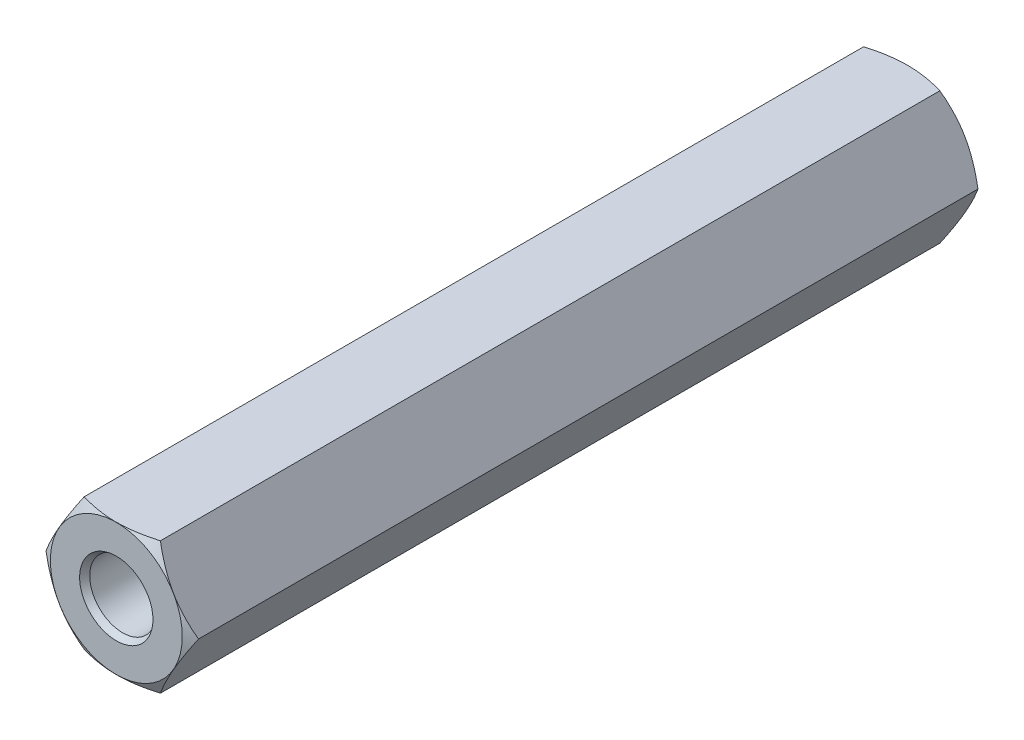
ISO-10303-21;
HEADER;
FILE_DESCRIPTION(('STEP AP214'),'2;1');
FILE_NAME('part.step','',(''),(''),'','','');
FILE_SCHEMA(('AUTOMOTIVE_DESIGN { 1 0 10303 214 1 1 1 1 }'));
ENDSEC;
DATA;
#1=APPLICATION_CONTEXT('core data for automotive mechanical design processes');
#2=APPLICATION_PROTOCOL_DEFINITION('international standard','automotive_design',2000,#1);
#3=PRODUCT_CONTEXT('',#1,'mechanical');
#4=PRODUCT('Part','Part','',(#3));
#5=PRODUCT_RELATED_PRODUCT_CATEGORY('part','',(#4));
#6=PRODUCT_DEFINITION_FORMATION('','',#4);
#7=PRODUCT_DEFINITION_CONTEXT('part definition',#1,'design');
#8=PRODUCT_DEFINITION('design','',#6,#7);
#9=PRODUCT_DEFINITION_SHAPE('','',#8);
#10=(LENGTH_UNIT() NAMED_UNIT(*) SI_UNIT(.MILLI.,.METRE.));
#11=(NAMED_UNIT(*) PLANE_ANGLE_UNIT() SI_UNIT($,.RADIAN.));
#12=(NAMED_UNIT(*) SI_UNIT($,.STERADIAN.) SOLID_ANGLE_UNIT());
#13=UNCERTAINTY_MEASURE_WITH_UNIT(LENGTH_MEASURE(1.E-05),#10,'distance_accuracy_value','');
#14=(GEOMETRIC_REPRESENTATION_CONTEXT(3) GLOBAL_UNCERTAINTY_ASSIGNED_CONTEXT((#13)) GLOBAL_UNIT_ASSIGNED_CONTEXT((#10,
#11,#12)) REPRESENTATION_CONTEXT('',''));
#15=CARTESIAN_POINT('',(0.,0.,0.));
#16=DIRECTION('',(0.,0.,1.));
#17=DIRECTION('',(1.,0.,0.));
#18=AXIS2_PLACEMENT_3D('',#15,#16,#17);
#19=CARTESIAN_POINT('',(0.,0.,22.));
#20=DIRECTION('',(0.,0.,1.));
#21=DIRECTION('',(1.,0.,0.));
#22=AXIS2_PLACEMENT_3D('',#19,#20,#21);
#23=CONICAL_SURFACE('',#22,1.25,1.047197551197);
#24=CARTESIAN_POINT('',(0.,0.,22.));
#25=DIRECTION('',(0.,0.,1.));
#26=DIRECTION('',(1.,0.,0.));
#27=AXIS2_PLACEMENT_3D('',#24,#25,#26);
#28=CIRCLE('',#27,1.25);
#29=CARTESIAN_POINT('',(1.25,0.,22.));
#30=VERTEX_POINT('',#29);
#31=EDGE_CURVE('E24',#30,#30,#28,.T.);
#32=ORIENTED_EDGE('',*,*,#31,.T.);
#33=DIRECTION('',(-0.866025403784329,0.,-0.50000000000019));
#34=VECTOR('',#33,1.);
#35=CARTESIAN_POINT('',(1.25,0.,22.));
#36=LINE('',#35,#34);
#37=CARTESIAN_POINT('',(0.,0.,21.278312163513));
#38=VERTEX_POINT('',#37);
#39=EDGE_CURVE('E11',#30,#38,#36,.T.);
#40=ORIENTED_EDGE('',*,*,#39,.T.);
#41=ORIENTED_EDGE('',*,*,#39,.F.);
#42=EDGE_LOOP('',(#32,#40,#41));
#43=FACE_BOUND('',#42,.T.);
#44=ADVANCED_FACE('F16',(#43),#23,.F.);
#45=CARTESIAN_POINT('',(0.,0.,29.75751288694));
#46=DIRECTION('',(0.,0.,-1.));
#47=DIRECTION('',(1.,0.,0.));
#48=AXIS2_PLACEMENT_3D('',#45,#46,#47);
#49=CYLINDRICAL_SURFACE('',#48,1.25);
#50=CARTESIAN_POINT('',(0.,0.,29.75751288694));
#51=DIRECTION('',(0.,0.,1.));
#52=DIRECTION('',(1.,0.,0.));
#53=AXIS2_PLACEMENT_3D('',#50,#51,#52);
#54=CIRCLE('',#53,1.25);
#55=CARTESIAN_POINT('',(1.25,0.,29.75751288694));
#56=VERTEX_POINT('',#55);
#57=EDGE_CURVE('E295',#56,#56,#54,.T.);
#58=ORIENTED_EDGE('',*,*,#57,.T.);
#59=DIRECTION('',(0.,0.,-1.));
#60=VECTOR('',#59,1.);
#61=CARTESIAN_POINT('',(1.25,0.,29.75751288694));
#62=LINE('',#61,#60);
#63=EDGE_CURVE('E299',#56,#30,#62,.T.);
#64=ORIENTED_EDGE('',*,*,#63,.T.);
#65=ORIENTED_EDGE('',*,*,#31,.F.);
#66=ORIENTED_EDGE('',*,*,#63,.F.);
#67=EDGE_LOOP('',(#58,#64,#65,#66));
#68=FACE_BOUND('',#67,.T.);
#69=ADVANCED_FACE('F306',(#68),#49,.F.);
#70=CARTESIAN_POINT('',(0.,0.,30.));
#71=DIRECTION('',(0.,0.,1.));
#72=DIRECTION('',(1.,0.,0.));
#73=AXIS2_PLACEMENT_3D('',#70,#71,#72);
#74=CONICAL_SURFACE('',#73,1.39,0.523598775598);
#75=CARTESIAN_POINT('',(0.,0.,30.));
#76=DIRECTION('',(0.,0.,1.));
#77=DIRECTION('',(1.,0.,0.));
#78=AXIS2_PLACEMENT_3D('',#75,#76,#77);
#79=CIRCLE('',#78,1.39);
#80=CARTESIAN_POINT('',(1.39,0.,30.));
#81=VERTEX_POINT('',#80);
#82=EDGE_CURVE('E285',#81,#81,#79,.T.);
#83=ORIENTED_EDGE('',*,*,#82,.T.);
#84=DIRECTION('',(-0.50000000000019,0.,-0.866025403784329));
#85=VECTOR('',#84,1.);
#86=CARTESIAN_POINT('',(1.39,0.,30.));
#87=LINE('',#86,#85);
#88=EDGE_CURVE('E289',#81,#56,#87,.T.);
#89=ORIENTED_EDGE('',*,*,#88,.T.);
#90=ORIENTED_EDGE('',*,*,#57,.F.);
#91=ORIENTED_EDGE('',*,*,#88,.F.);
#92=EDGE_LOOP('',(#83,#89,#90,#91));
#93=FACE_BOUND('',#92,.T.);
#94=ADVANCED_FACE('F309',(#93),#74,.F.);
#95=CARTESIAN_POINT('',(0.,0.,30.));
#96=DIRECTION('',(0.,0.,1.));
#97=DIRECTION('',(1.,0.,0.));
#98=AXIS2_PLACEMENT_3D('',#95,#96,#97);
#99=PLANE('',#98);
#100=ORIENTED_EDGE('',*,*,#82,.F.);
#101=EDGE_LOOP('',(#100));
#102=FACE_BOUND('',#101,.T.);
#103=CARTESIAN_POINT('',(0.,0.,30.));
#104=DIRECTION('',(0.,0.,1.));
#105=DIRECTION('',(1.,0.,0.));
#106=AXIS2_PLACEMENT_3D('',#103,#104,#105);
#107=CIRCLE('',#106,2.5);
#108=CARTESIAN_POINT('',(2.5,0.,30.));
#109=VERTEX_POINT('',#108);
#110=EDGE_CURVE('E284',#109,#109,#107,.T.);
#111=ORIENTED_EDGE('',*,*,#110,.T.);
#112=EDGE_LOOP('',(#111));
#113=FACE_BOUND('',#112,.T.);
#114=ADVANCED_FACE('F312',(#102,#113),#99,.T.);
#115=CARTESIAN_POINT('',(0.,0.,29.774833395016));
#116=DIRECTION('',(0.,0.,-1.));
#117=DIRECTION('',(1.,0.,0.));
#118=AXIS2_PLACEMENT_3D('',#115,#116,#117);
#119=CONICAL_SURFACE('',#118,2.89,1.047197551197);
#120=CARTESIAN_POINT('',(2.89000000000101,6.3860028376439E-13,29.7748333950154));
#121=CARTESIAN_POINT('',(2.16750000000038,-1.25140670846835,30.1919689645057));
#122=CARTESIAN_POINT('',(1.44499999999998,-2.50281341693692,29.7748333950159));
#123=(BOUNDED_CURVE() B_SPLINE_CURVE(2,(#120,#121,#122),.UNSPECIFIED.,.F.,
.F.) B_SPLINE_CURVE_WITH_KNOTS((3,3),(0.,1.),
.UNSPECIFIED.) CURVE() GEOMETRIC_REPRESENTATION_ITEM() RATIONAL_B_SPLINE_CURVE((1.,
1.15470053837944,1.)) REPRESENTATION_ITEM(''));
#124=CARTESIAN_POINT('',(2.89,0.,29.774833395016));
#125=VERTEX_POINT('',#124);
#126=CARTESIAN_POINT('',(1.445,-2.502813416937,29.774833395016));
#127=VERTEX_POINT('',#126);
#128=EDGE_CURVE('E269',#125,#127,#123,.T.);
#129=ORIENTED_EDGE('',*,*,#128,.F.);
#130=DIRECTION('',(-0.866025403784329,0.,0.50000000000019));
#131=VECTOR('',#130,1.);
#132=CARTESIAN_POINT('',(2.89,0.,29.774833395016));
#133=LINE('',#132,#131);
#134=EDGE_CURVE('E277',#125,#109,#133,.T.);
#135=ORIENTED_EDGE('',*,*,#134,.T.);
#136=ORIENTED_EDGE('',*,*,#110,.F.);
#137=ORIENTED_EDGE('',*,*,#134,.F.);
#138=CARTESIAN_POINT('',(1.44499999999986,2.50281341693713,29.7748333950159));
#139=CARTESIAN_POINT('',(2.16750000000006,1.25140670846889,30.1919689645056));
#140=CARTESIAN_POINT('',(2.89000000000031,5.85975712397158E-13,29.7748333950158));
#141=(BOUNDED_CURVE() B_SPLINE_CURVE(2,(#138,#139,#140),.UNSPECIFIED.,.F.,
.F.) B_SPLINE_CURVE_WITH_KNOTS((3,3),(0.,1.),
.UNSPECIFIED.) CURVE() GEOMETRIC_REPRESENTATION_ITEM() RATIONAL_B_SPLINE_CURVE((1.,
1.15470053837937,1.)) REPRESENTATION_ITEM(''));
#142=CARTESIAN_POINT('',(1.445,2.502813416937,29.774833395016));
#143=VERTEX_POINT('',#142);
#144=EDGE_CURVE('E132',#143,#125,#141,.T.);
#145=ORIENTED_EDGE('',*,*,#144,.F.);
#146=CARTESIAN_POINT('',(-1.44500000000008,2.502813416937,29.7748333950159));
#147=CARTESIAN_POINT('',(0.,2.50281341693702,30.1919689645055));
#148=CARTESIAN_POINT('',(1.44499999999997,2.502813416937,29.774833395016));
#149=(BOUNDED_CURVE() B_SPLINE_CURVE(2,(#146,#147,#148),.UNSPECIFIED.,.F.,
.F.) B_SPLINE_CURVE_WITH_KNOTS((3,3),(0.,1.),
.UNSPECIFIED.) CURVE() GEOMETRIC_REPRESENTATION_ITEM() RATIONAL_B_SPLINE_CURVE((1.,
1.15470053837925,1.)) REPRESENTATION_ITEM(''));
#150=CARTESIAN_POINT('',(-1.445,2.502813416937,29.774833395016));
#151=VERTEX_POINT('',#150);
#152=EDGE_CURVE('E228',#151,#143,#149,.T.);
#153=ORIENTED_EDGE('',*,*,#152,.F.);
#154=CARTESIAN_POINT('',(-2.89000000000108,-7.47846229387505E-13,29.7748333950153));
#155=CARTESIAN_POINT('',(-2.1675000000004,1.25140670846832,30.1919689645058));
#156=CARTESIAN_POINT('',(-1.44499999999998,2.50281341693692,29.7748333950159));
#157=(BOUNDED_CURVE() B_SPLINE_CURVE(2,(#154,#155,#156),.UNSPECIFIED.,.F.,
.F.) B_SPLINE_CURVE_WITH_KNOTS((3,3),(0.,1.),
.UNSPECIFIED.) CURVE() GEOMETRIC_REPRESENTATION_ITEM() RATIONAL_B_SPLINE_CURVE((1.,
1.15470053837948,1.)) REPRESENTATION_ITEM(''));
#158=CARTESIAN_POINT('',(-2.89,0.,29.774833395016));
#159=VERTEX_POINT('',#158);
#160=EDGE_CURVE('E240',#159,#151,#157,.T.);
#161=ORIENTED_EDGE('',*,*,#160,.F.);
#162=CARTESIAN_POINT('',(-1.44499999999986,-2.50281341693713,29.7748333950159));
#163=CARTESIAN_POINT('',(-2.16750000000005,-1.25140670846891,30.1919689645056));
#164=CARTESIAN_POINT('',(-2.89000000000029,-6.22391027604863E-13,29.7748333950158));
#165=(BOUNDED_CURVE() B_SPLINE_CURVE(2,(#162,#163,#164),.UNSPECIFIED.,.F.,
.F.) B_SPLINE_CURVE_WITH_KNOTS((3,3),(0.,1.),
.UNSPECIFIED.) CURVE() GEOMETRIC_REPRESENTATION_ITEM() RATIONAL_B_SPLINE_CURVE((1.,
1.15470053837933,1.)) REPRESENTATION_ITEM(''));
#166=CARTESIAN_POINT('',(-1.445,-2.502813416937,29.774833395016));
#167=VERTEX_POINT('',#166);
#168=EDGE_CURVE('E252',#167,#159,#165,.T.);
#169=ORIENTED_EDGE('',*,*,#168,.F.);
#170=CARTESIAN_POINT('',(1.44500000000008,-2.502813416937,29.7748333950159));
#171=CARTESIAN_POINT('',(0.,-2.50281341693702,30.1919689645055));
#172=CARTESIAN_POINT('',(-1.44499999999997,-2.502813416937,29.774833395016));
#173=(BOUNDED_CURVE() B_SPLINE_CURVE(2,(#170,#171,#172),.UNSPECIFIED.,.F.,
.F.) B_SPLINE_CURVE_WITH_KNOTS((3,3),(0.,1.),
.UNSPECIFIED.) CURVE() GEOMETRIC_REPRESENTATION_ITEM() RATIONAL_B_SPLINE_CURVE((1.,
1.15470053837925,1.)) REPRESENTATION_ITEM(''));
#174=EDGE_CURVE('E264',#127,#167,#173,.T.);
#175=ORIENTED_EDGE('',*,*,#174,.F.);
#176=EDGE_LOOP('',(#129,#135,#136,#137,#145,#153,#161,#169,#175));
#177=FACE_BOUND('',#176,.T.);
#178=ADVANCED_FACE('F315',(#177),#119,.T.);
#179=CARTESIAN_POINT('',(1.445,-2.502813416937,0.));
#180=DIRECTION('',(-0.866025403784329,0.50000000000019,0.));
#181=DIRECTION('',(0.,0.,1.));
#182=AXIS2_PLACEMENT_3D('',#179,#180,#181);
#183=PLANE('',#182);
#184=DIRECTION('',(0.,0.,1.));
#185=VECTOR('',#184,1.);
#186=CARTESIAN_POINT('',(2.89,0.,0.225166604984));
#187=LINE('',#186,#185);
#188=CARTESIAN_POINT('',(2.89,0.,0.225166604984));
#189=VERTEX_POINT('',#188);
#190=EDGE_CURVE('E136',#189,#125,#187,.T.);
#191=ORIENTED_EDGE('',*,*,#190,.T.);
#192=ORIENTED_EDGE('',*,*,#128,.T.);
#193=DIRECTION('',(0.,0.,1.));
#194=VECTOR('',#193,1.);
#195=CARTESIAN_POINT('',(1.445,-2.502813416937,0.));
#196=LINE('',#195,#194);
#197=CARTESIAN_POINT('',(1.445,-2.502813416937,0.225166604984));
#198=VERTEX_POINT('',#197);
#199=EDGE_CURVE('E257',#198,#127,#196,.T.);
#200=ORIENTED_EDGE('',*,*,#199,.F.);
#201=CARTESIAN_POINT('',(1.44499999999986,-2.50281341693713,0.225166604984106));
#202=CARTESIAN_POINT('',(2.16750000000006,-1.25140670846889,-0.191968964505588));
#203=CARTESIAN_POINT('',(2.89000000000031,-5.83089132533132E-13,0.225166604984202));
#204=(BOUNDED_CURVE() B_SPLINE_CURVE(2,(#201,#202,#203),.UNSPECIFIED.,.F.,
.F.) B_SPLINE_CURVE_WITH_KNOTS((3,3),(0.,1.),
.UNSPECIFIED.) CURVE() GEOMETRIC_REPRESENTATION_ITEM() RATIONAL_B_SPLINE_CURVE((1.,
1.15470053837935,1.)) REPRESENTATION_ITEM(''));
#205=EDGE_CURVE('E171',#198,#189,#204,.T.);
#206=ORIENTED_EDGE('',*,*,#205,.T.);
#207=EDGE_LOOP('',(#191,#192,#200,#206));
#208=FACE_BOUND('',#207,.T.);
#209=ADVANCED_FACE('F323',(#208),#183,.F.);
#210=CARTESIAN_POINT('',(-1.445,-2.502813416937,0.));
#211=DIRECTION('',(0.,1.,0.));
#212=DIRECTION('',(1.,0.,0.));
#213=AXIS2_PLACEMENT_3D('',#210,#211,#212);
#214=PLANE('',#213);
#215=ORIENTED_EDGE('',*,*,#199,.T.);
#216=ORIENTED_EDGE('',*,*,#174,.T.);
#217=DIRECTION('',(0.,0.,1.));
#218=VECTOR('',#217,1.);
#219=CARTESIAN_POINT('',(-1.445,-2.502813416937,0.));
#220=LINE('',#219,#218);
#221=CARTESIAN_POINT('',(-1.445,-2.502813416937,0.225166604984));
#222=VERTEX_POINT('',#221);
#223=EDGE_CURVE('E245',#222,#167,#220,.T.);
#224=ORIENTED_EDGE('',*,*,#223,.F.);
#225=CARTESIAN_POINT('',(-1.44500000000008,-2.502813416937,0.225166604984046));
#226=CARTESIAN_POINT('',(0.,-2.50281341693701,-0.191968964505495));
#227=CARTESIAN_POINT('',(1.44499999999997,-2.502813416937,0.225166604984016));
#228=(BOUNDED_CURVE() B_SPLINE_CURVE(2,(#225,#226,#227),.UNSPECIFIED.,.F.,
.F.) B_SPLINE_CURVE_WITH_KNOTS((3,3),(0.,1.),
.UNSPECIFIED.) CURVE() GEOMETRIC_REPRESENTATION_ITEM() RATIONAL_B_SPLINE_CURVE((1.,
1.15470053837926,1.)) REPRESENTATION_ITEM(''));
#229=EDGE_CURVE('E165',#222,#198,#228,.T.);
#230=ORIENTED_EDGE('',*,*,#229,.T.);
#231=EDGE_LOOP('',(#215,#216,#224,#230));
#232=FACE_BOUND('',#231,.T.);
#233=ADVANCED_FACE('F341',(#232),#214,.F.);
#234=CARTESIAN_POINT('',(-2.89,0.,0.));
#235=DIRECTION('',(0.866025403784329,0.50000000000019,0.));
#236=DIRECTION('',(0.,0.,-1.));
#237=AXIS2_PLACEMENT_3D('',#234,#235,#236);
#238=PLANE('',#237);
#239=ORIENTED_EDGE('',*,*,#223,.T.);
#240=ORIENTED_EDGE('',*,*,#168,.T.);
#241=DIRECTION('',(0.,0.,1.));
#242=VECTOR('',#241,1.);
#243=CARTESIAN_POINT('',(-2.89,0.,0.));
#244=LINE('',#243,#242);
#245=CARTESIAN_POINT('',(-2.89,0.,0.225166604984));
#246=VERTEX_POINT('',#245);
#247=EDGE_CURVE('E233',#246,#159,#244,.T.);
#248=ORIENTED_EDGE('',*,*,#247,.F.);
#249=CARTESIAN_POINT('',(-2.89000000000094,5.09592368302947E-13,0.225166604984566));
#250=CARTESIAN_POINT('',(-2.16750000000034,-1.2514067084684,-0.191968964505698));
#251=CARTESIAN_POINT('',(-1.44499999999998,-2.50281341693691,0.225166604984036));
#252=(BOUNDED_CURVE() B_SPLINE_CURVE(2,(#249,#250,#251),.UNSPECIFIED.,.F.,
.F.) B_SPLINE_CURVE_WITH_KNOTS((3,3),(0.,1.),
.UNSPECIFIED.) CURVE() GEOMETRIC_REPRESENTATION_ITEM() RATIONAL_B_SPLINE_CURVE((1.,
1.15470053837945,1.)) REPRESENTATION_ITEM(''));
#253=EDGE_CURVE('E157',#246,#222,#252,.T.);
#254=ORIENTED_EDGE('',*,*,#253,.T.);
#255=EDGE_LOOP('',(#239,#240,#248,#254));
#256=FACE_BOUND('',#255,.T.);
#257=ADVANCED_FACE('F338',(#256),#238,.F.);
#258=CARTESIAN_POINT('',(-1.445,2.502813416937,0.));
#259=DIRECTION('',(0.866025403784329,-0.50000000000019,0.));
#260=DIRECTION('',(0.,0.,-1.));
#261=AXIS2_PLACEMENT_3D('',#258,#259,#260);
#262=PLANE('',#261);
#263=ORIENTED_EDGE('',*,*,#247,.T.);
#264=ORIENTED_EDGE('',*,*,#160,.T.);
#265=DIRECTION('',(0.,0.,1.));
#266=VECTOR('',#265,1.);
#267=CARTESIAN_POINT('',(-1.445,2.502813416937,0.));
#268=LINE('',#267,#266);
#269=CARTESIAN_POINT('',(-1.445,2.502813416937,0.225166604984));
#270=VERTEX_POINT('',#269);
#271=EDGE_CURVE('E224',#270,#151,#268,.T.);
#272=ORIENTED_EDGE('',*,*,#271,.F.);
#273=CARTESIAN_POINT('',(-1.44499999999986,2.50281341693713,0.225166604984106));
#274=CARTESIAN_POINT('',(-2.16750000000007,1.25140670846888,-0.191968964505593));
#275=CARTESIAN_POINT('',(-2.89000000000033,5.42899059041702E-13,0.225166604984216));
#276=(BOUNDED_CURVE() B_SPLINE_CURVE(2,(#273,#274,#275),.UNSPECIFIED.,.F.,
.F.) B_SPLINE_CURVE_WITH_KNOTS((3,3),(0.,1.),
.UNSPECIFIED.) CURVE() GEOMETRIC_REPRESENTATION_ITEM() RATIONAL_B_SPLINE_CURVE((1.,
1.15470053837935,1.)) REPRESENTATION_ITEM(''));
#277=EDGE_CURVE('E150',#270,#246,#276,.T.);
#278=ORIENTED_EDGE('',*,*,#277,.T.);
#279=EDGE_LOOP('',(#263,#264,#272,#278));
#280=FACE_BOUND('',#279,.T.);
#281=ADVANCED_FACE('F335',(#280),#262,.F.);
#282=CARTESIAN_POINT('',(1.445,2.502813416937,0.));
#283=DIRECTION('',(0.,-1.,0.));
#284=DIRECTION('',(-1.,0.,0.));
#285=AXIS2_PLACEMENT_3D('',#282,#283,#284);
#286=PLANE('',#285);
#287=ORIENTED_EDGE('',*,*,#271,.T.);
#288=ORIENTED_EDGE('',*,*,#152,.T.);
#289=DIRECTION('',(0.,0.,1.));
#290=VECTOR('',#289,1.);
#291=CARTESIAN_POINT('',(1.445,2.502813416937,0.));
#292=LINE('',#291,#290);
#293=CARTESIAN_POINT('',(1.445,2.502813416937,0.225166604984));
#294=VERTEX_POINT('',#293);
#295=EDGE_CURVE('E137',#294,#143,#292,.T.);
#296=ORIENTED_EDGE('',*,*,#295,.F.);
#297=CARTESIAN_POINT('',(1.44500000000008,2.502813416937,0.225166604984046));
#298=CARTESIAN_POINT('',(0.,2.50281341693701,-0.191968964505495));
#299=CARTESIAN_POINT('',(-1.44499999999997,2.502813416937,0.225166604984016));
#300=(BOUNDED_CURVE() B_SPLINE_CURVE(2,(#297,#298,#299),.UNSPECIFIED.,.F.,
.F.) B_SPLINE_CURVE_WITH_KNOTS((3,3),(0.,1.),
.UNSPECIFIED.) CURVE() GEOMETRIC_REPRESENTATION_ITEM() RATIONAL_B_SPLINE_CURVE((1.,
1.15470053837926,1.)) REPRESENTATION_ITEM(''));
#301=EDGE_CURVE('E156',#294,#270,#300,.T.);
#302=ORIENTED_EDGE('',*,*,#301,.T.);
#303=EDGE_LOOP('',(#287,#288,#296,#302));
#304=FACE_BOUND('',#303,.T.);
#305=ADVANCED_FACE('F331',(#304),#286,.F.);
#306=CARTESIAN_POINT('',(2.89,0.,0.));
#307=DIRECTION('',(-0.866025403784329,-0.50000000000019,0.));
#308=DIRECTION('',(-0.50000000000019,0.866025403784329,0.));
#309=AXIS2_PLACEMENT_3D('',#306,#307,#308);
#310=PLANE('',#309);
#311=ORIENTED_EDGE('',*,*,#295,.T.);
#312=ORIENTED_EDGE('',*,*,#144,.T.);
#313=ORIENTED_EDGE('',*,*,#190,.F.);
#314=CARTESIAN_POINT('',(2.89000000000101,-6.28830321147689E-13,0.225166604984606));
#315=CARTESIAN_POINT('',(2.16750000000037,1.25140670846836,-0.191968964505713));
#316=CARTESIAN_POINT('',(1.44499999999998,2.50281341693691,0.225166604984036));
#317=(BOUNDED_CURVE() B_SPLINE_CURVE(2,(#314,#315,#316),.UNSPECIFIED.,.F.,
.F.) B_SPLINE_CURVE_WITH_KNOTS((3,3),(0.,1.),
.UNSPECIFIED.) CURVE() GEOMETRIC_REPRESENTATION_ITEM() RATIONAL_B_SPLINE_CURVE((1.,
1.15470053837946,1.)) REPRESENTATION_ITEM(''));
#318=EDGE_CURVE('E204',#189,#294,#317,.T.);
#319=ORIENTED_EDGE('',*,*,#318,.T.);
#320=EDGE_LOOP('',(#311,#312,#313,#319));
#321=FACE_BOUND('',#320,.T.);
#322=ADVANCED_FACE('F327',(#321),#310,.F.);
#323=CARTESIAN_POINT('',(0.,0.,0.));
#324=DIRECTION('',(0.,0.,1.));
#325=DIRECTION('',(1.,0.,0.));
#326=AXIS2_PLACEMENT_3D('',#323,#324,#325);
#327=CONICAL_SURFACE('',#326,2.5,1.047197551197);
#328=DIRECTION('',(0.866025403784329,0.,0.50000000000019));
#329=VECTOR('',#328,1.);
#330=CARTESIAN_POINT('',(2.5,0.,0.));
#331=LINE('',#330,#329);
#332=CARTESIAN_POINT('',(2.5,0.,0.));
#333=VERTEX_POINT('',#332);
#334=EDGE_CURVE('E181',#333,#189,#331,.T.);
#335=ORIENTED_EDGE('',*,*,#334,.F.);
#336=CARTESIAN_POINT('',(0.,0.,0.));
#337=DIRECTION('',(0.,0.,1.));
#338=DIRECTION('',(1.,0.,0.));
#339=AXIS2_PLACEMENT_3D('',#336,#337,#338);
#340=CIRCLE('',#339,2.5);
#341=EDGE_CURVE('E177',#333,#333,#340,.T.);
#342=ORIENTED_EDGE('',*,*,#341,.T.);
#343=ORIENTED_EDGE('',*,*,#334,.T.);
#344=ORIENTED_EDGE('',*,*,#205,.F.);
#345=ORIENTED_EDGE('',*,*,#229,.F.);
#346=ORIENTED_EDGE('',*,*,#253,.F.);
#347=ORIENTED_EDGE('',*,*,#277,.F.);
#348=ORIENTED_EDGE('',*,*,#301,.F.);
#349=ORIENTED_EDGE('',*,*,#318,.F.);
#350=EDGE_LOOP('',(#335,#342,#343,#344,#345,#346,#347,#348,#349));
#351=FACE_BOUND('',#350,.T.);
#352=ADVANCED_FACE('F343',(#351),#327,.T.);
#353=CARTESIAN_POINT('',(0.,0.,0.));
#354=DIRECTION('',(0.,0.,1.));
#355=DIRECTION('',(1.,0.,0.));
#356=AXIS2_PLACEMENT_3D('',#353,#354,#355);
#357=PLANE('',#356);
#358=ORIENTED_EDGE('',*,*,#341,.F.);
#359=EDGE_LOOP('',(#358));
#360=FACE_BOUND('',#359,.T.);
#361=CARTESIAN_POINT('',(0.,0.,0.));
#362=DIRECTION('',(0.,0.,1.));
#363=DIRECTION('',(1.,0.,0.));
#364=AXIS2_PLACEMENT_3D('',#361,#362,#363);
#365=CIRCLE('',#364,1.39);
#366=CARTESIAN_POINT('',(1.39,0.,0.));
#367=VERTEX_POINT('',#366);
#368=EDGE_CURVE('E164',#367,#367,#365,.T.);
#369=ORIENTED_EDGE('',*,*,#368,.T.);
#370=EDGE_LOOP('',(#369));
#371=FACE_BOUND('',#370,.T.);
#372=ADVANCED_FACE('F346',(#360,#371),#357,.F.);
#373=CARTESIAN_POINT('',(0.,0.,0.24248711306));
#374=DIRECTION('',(0.,0.,-1.));
#375=DIRECTION('',(1.,0.,0.));
#376=AXIS2_PLACEMENT_3D('',#373,#374,#375);
#377=CONICAL_SURFACE('',#376,1.25,0.523598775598);
#378=CARTESIAN_POINT('',(0.,0.,0.24248711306));
#379=DIRECTION('',(0.,0.,1.));
#380=DIRECTION('',(1.,0.,0.));
#381=AXIS2_PLACEMENT_3D('',#378,#379,#380);
#382=CIRCLE('',#381,1.25);
#383=CARTESIAN_POINT('',(1.25,0.,0.24248711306));
#384=VERTEX_POINT('',#383);
#385=EDGE_CURVE('E145',#384,#384,#382,.T.);
#386=ORIENTED_EDGE('',*,*,#385,.T.);
#387=DIRECTION('',(0.50000000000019,0.,-0.866025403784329));
#388=VECTOR('',#387,1.);
#389=CARTESIAN_POINT('',(1.25,0.,0.24248711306));
#390=LINE('',#389,#388);
#391=EDGE_CURVE('E149',#384,#367,#390,.T.);
#392=ORIENTED_EDGE('',*,*,#391,.T.);
#393=ORIENTED_EDGE('',*,*,#368,.F.);
#394=ORIENTED_EDGE('',*,*,#391,.F.);
#395=EDGE_LOOP('',(#386,#392,#393,#394));
#396=FACE_BOUND('',#395,.T.);
#397=ADVANCED_FACE('F349',(#396),#377,.F.);
#398=CARTESIAN_POINT('',(0.,0.,8.));
#399=DIRECTION('',(0.,0.,-1.));
#400=DIRECTION('',(1.,0.,0.));
#401=AXIS2_PLACEMENT_3D('',#398,#399,#400);
#402=CYLINDRICAL_SURFACE('',#401,1.25);
#403=CARTESIAN_POINT('',(0.,0.,8.));
#404=DIRECTION('',(0.,0.,1.));
#405=DIRECTION('',(1.,0.,0.));
#406=AXIS2_PLACEMENT_3D('',#403,#404,#405);
#407=CIRCLE('',#406,1.25);
#408=CARTESIAN_POINT('',(1.25,0.,8.));
#409=VERTEX_POINT('',#408);
#410=EDGE_CURVE('E123',#409,#409,#407,.T.);
#411=ORIENTED_EDGE('',*,*,#410,.T.);
#412=DIRECTION('',(0.,0.,-1.));
#413=VECTOR('',#412,1.);
#414=CARTESIAN_POINT('',(1.25,0.,8.));
#415=LINE('',#414,#413);
#416=EDGE_CURVE('E129',#409,#384,#415,.T.);
#417=ORIENTED_EDGE('',*,*,#416,.T.);
#418=ORIENTED_EDGE('',*,*,#385,.F.);
#419=ORIENTED_EDGE('',*,*,#416,.F.);
#420=EDGE_LOOP('',(#411,#417,#418,#419));
#421=FACE_BOUND('',#420,.T.);
#422=ADVANCED_FACE('F355',(#421),#402,.F.);
#423=CARTESIAN_POINT('',(0.,0.,7.721687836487));
#424=DIRECTION('',(0.,0.,-1.));
#425=DIRECTION('',(1.,0.,0.));
#426=AXIS2_PLACEMENT_3D('',#423,#424,#425);
#427=CONICAL_SURFACE('',#426,1.73205080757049,1.047197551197);
#428=DIRECTION('',(0.866025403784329,0.,-0.50000000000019));
#429=VECTOR('',#428,1.);
#430=CARTESIAN_POINT('',(0.,0.,8.721687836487));
#431=LINE('',#430,#429);
#432=CARTESIAN_POINT('',(0.,0.,8.721687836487));
#433=VERTEX_POINT('',#432);
#434=EDGE_CURVE('E120',#433,#409,#431,.T.);
#435=ORIENTED_EDGE('',*,*,#434,.T.);
#436=ORIENTED_EDGE('',*,*,#410,.F.);
#437=ORIENTED_EDGE('',*,*,#434,.F.);
#438=EDGE_LOOP('',(#435,#436,#437));
#439=FACE_BOUND('',#438,.T.);
#440=ADVANCED_FACE('F121',(#439),#427,.F.);
#441=CLOSED_SHELL('',(#44,#69,#94,#114,#178,#209,#233,#257,#281,#305,#322,#352,#372,#397,#422,#440));
#442=MANIFOLD_SOLID_BREP('B1',#441);
#443=ADVANCED_BREP_SHAPE_REPRESENTATION('',(#18,#442),#14);
#444=SHAPE_DEFINITION_REPRESENTATION(#9,#443);
ENDSEC;
END-ISO-10303-21;
